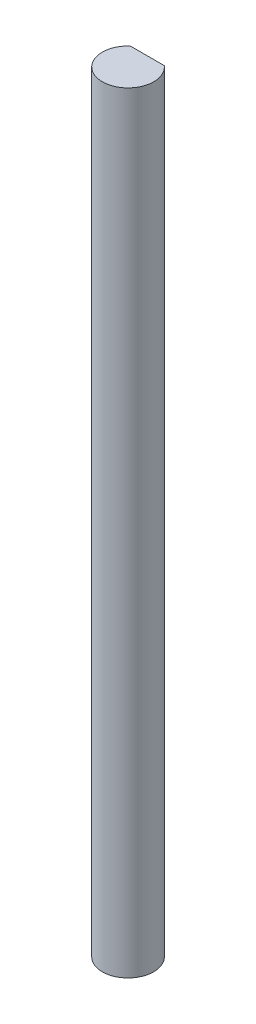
from build123d import *

# Parameters (mm, degrees)
LENGTH_DEPTH       = 60
CUT_EXTRUDE1_DEPTH = 12


with BuildPart() as part:
    # Sketch1 → Length (new body)
    with BuildSketch(Plane(origin=(0, 0, 0), x_dir=(1, 0, 0), z_dir=(0, 1, 0))):
        with BuildLine():
            ThreePointArc((1.322875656, 1.5), (0, 2), (-1.322875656, 1.5))
            Line((-1.322875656, 1.5), (1.322875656, 1.5))
        make_face()
        with BuildLine():
            Line((1.322875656, 1.5), (-1.322875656, 1.5))
            ThreePointArc((-1.322875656, 1.5), (-0.822875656, -1.822875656), (2, 0))
            ThreePointArc((2, 0), (1.822875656, 0.822875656), (1.322875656, 1.5))
        make_face()
        with BuildLine():
            ThreePointArc((1.322875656, 1.5), (0, 2), (-1.322875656, 1.5))
            Line((-1.322875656, 1.5), (1.322875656, 1.5))
        make_face()
        with BuildLine():
            Line((1.322875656, 1.5), (-1.322875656, 1.5))
            ThreePointArc((-1.322875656, 1.5), (-0.822875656, -1.822875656), (2, 0))
            ThreePointArc((2, 0), (1.822875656, 0.822875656), (1.322875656, 1.5))
        make_face()
    extrude(amount=LENGTH_DEPTH)

    # Sketch1_3 → Cut-Extrude1 (cut)
    with BuildSketch(Plane(origin=(0, 0, 0), x_dir=(1, 0, 0), z_dir=(0, 1, 0))):
        Polygon((-20.975129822, 1.5), (-1.322875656, 1.5), (1.322875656, 1.5), (20.975129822, 1.5), (20.975129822, 40.804508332), (-20.975129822, 40.804508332), align=None)
    cut_extrude1 = extrude(amount=CUT_EXTRUDE1_DEPTH, mode=Mode.SUBTRACT)

    # Mirror1: Cut-Extrude1 across plane
    add(cut_extrude1.mirror(Plane(origin=(0, 30, 0), x_dir=(0, 0, 1), z_dir=(0, -1, 0))), mode=Mode.SUBTRACT)


solid = part.part
